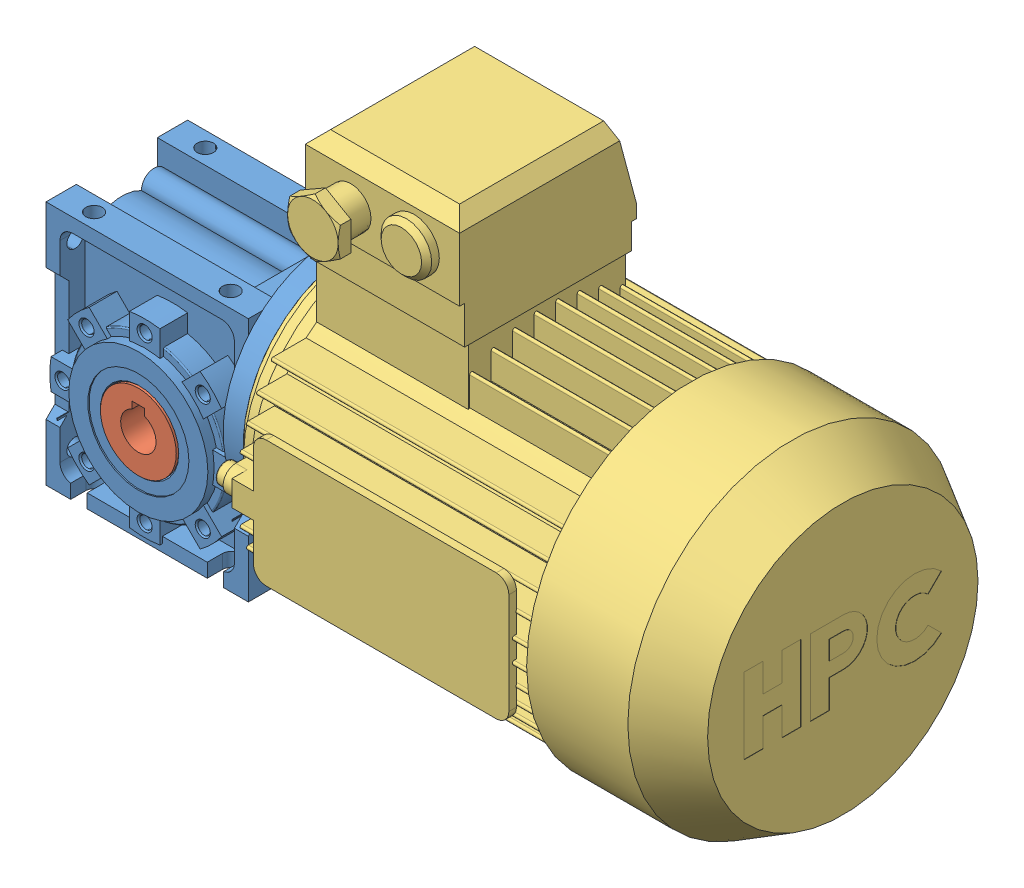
SolidWorks assembly CHM30-20-63C4.SLDASM, configuration Défaut (file format 10000). Lengths in mm.
Overall size (287 180 130).
3 component instances, 3 part files, 0 mates.
Components (placement in the parent):
- HI_hpc_CHM30-20-63C4_1-1: HI_hpc_CHM30-20-63C4_1.sldprt [Défaut] x (0 0 -1) z (1 0 0) size (90 115 95)
- HI_hpc_CHM30-MOT_3-1: HI_hpc_CHM30-MOT_3.sldprt [Défaut] at origin size (30 30 63)
- HI_hpc_CHM30-20-63C4_2-1: HI_hpc_CHM30-20-63C4_2.sldprt [Défaut] at (52.5 30 0) size (194.5 175 130)
